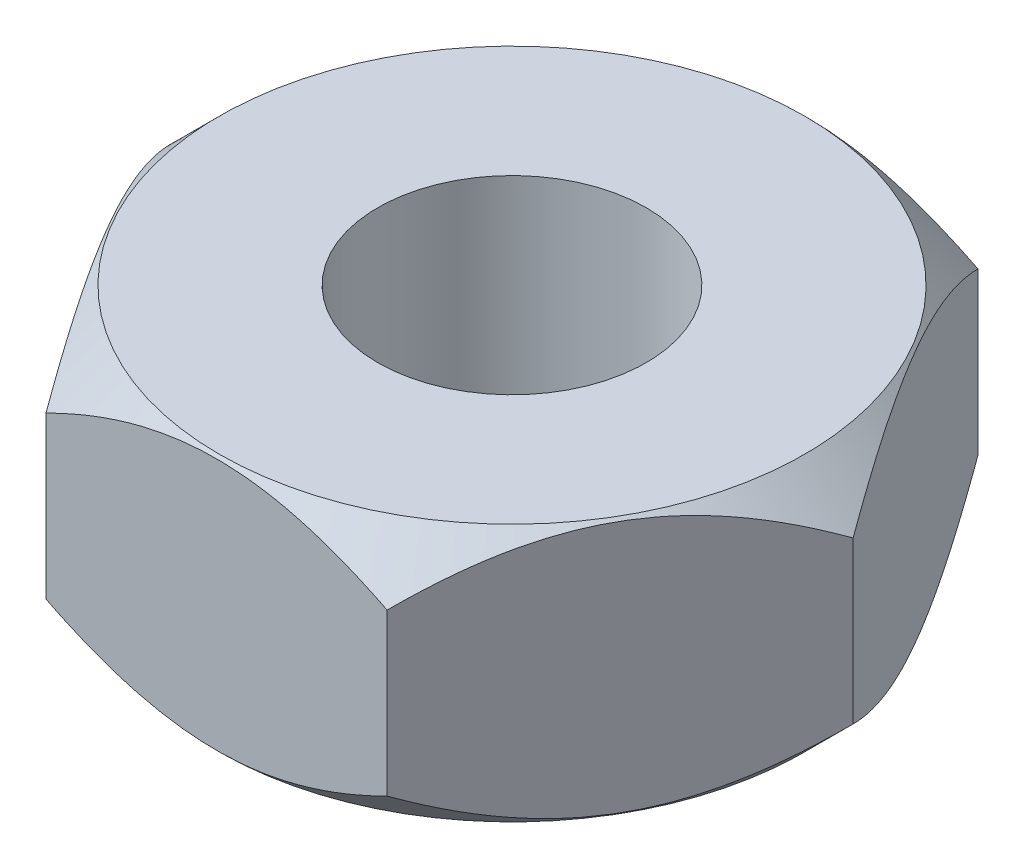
from build123d import *

# Parameters (mm, degrees)
AUFSATZ_LINEAR_AUSTRAGEN1_DEPTH = 2.4
F_1_0_1_DURCHMESSER_BOHRUNG1_D  = 2.5


with BuildPart() as part:
    # Skizze1 → Aufsatz-Linear austragen1 (new body)
    with BuildSketch(Plane(origin=(0, 0, 0), x_dir=(1, 0, 0), z_dir=(0, 1, 0))):
        Polygon((1.58771324, 2.75), (-1.58771324, 2.75), (-3.175426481, 0), (-1.58771324, -2.75), (1.58771324, -2.75), (3.175426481, 0), align=None)
    extrude(amount=AUFSATZ_LINEAR_AUSTRAGEN1_DEPTH)

    # 1.0 _1_ Durchmesser Bohrung1 (through all)
    with Locations(Plane(origin=(0, 2.4, 0), x_dir=(1, 0, 0), z_dir=(0, 1, 0))):
        with Locations((0, 0)):
            Hole(F_1_0_1_DURCHMESSER_BOHRUNG1_D / 2)

    # Skizze4 → Schnitt-Rotation1 (revolve, cut)
    with BuildSketch(Plane.XY, mode=Mode.PRIVATE) as schnitt_rotation1_sk:
        Polygon((-3.175426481, 1.95), (-2.725426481, 2.4), (-3.175426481, 2.4), align=None)
        Polygon((-3.175426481, 0), (-2.725426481, 0), (-3.175426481, 0.45), align=None)
    revolve(schnitt_rotation1_sk.sketch.rotate(Axis((0, 0, 0), (0, 1, 0)), 120.000000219), axis=Axis((0, 0, 0), (0, 1, 0)), mode=Mode.SUBTRACT)


solid = part.part
